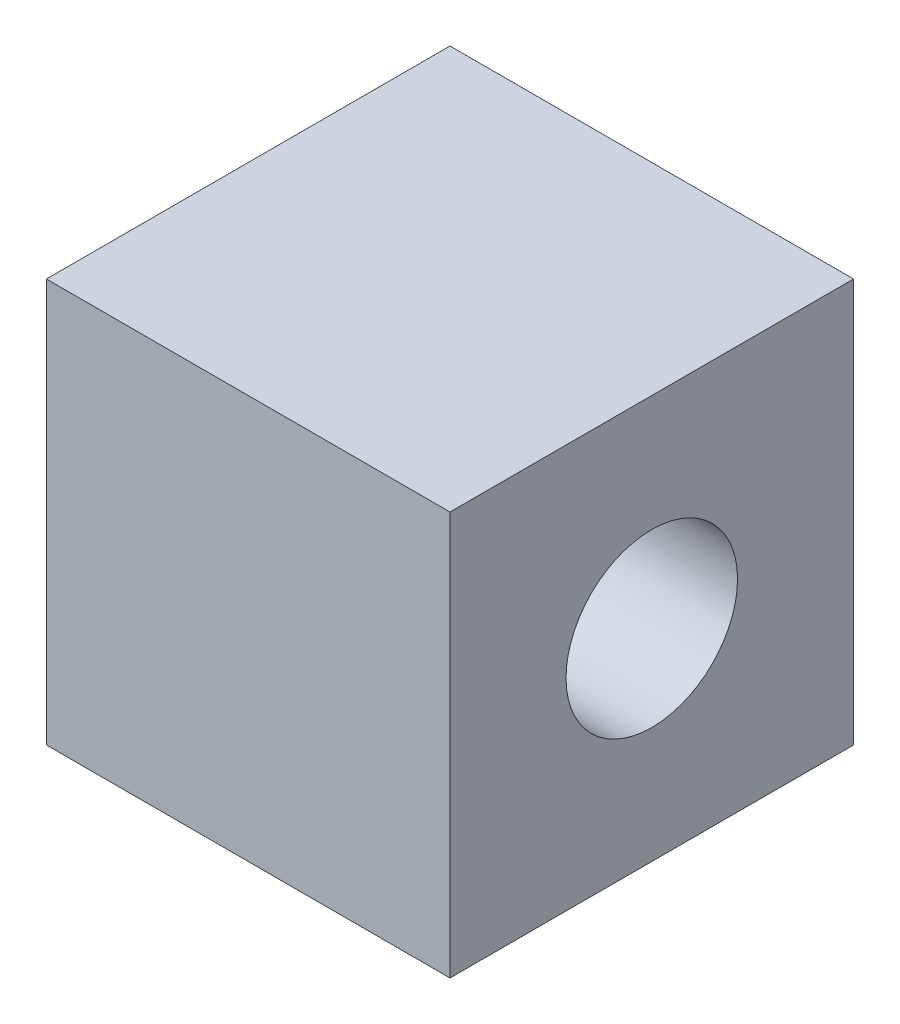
from build123d import *

# Parameters (mm, degrees)
SKETCH1_W           = 20
SKETCH1_H           = 20
BOSS_EXTRUDE1_DEPTH = 20
SKETCH2_R           = 4.25
CUT_EXTRUDE1_DEPTH  = 25.494897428


with BuildPart() as part:
    # Sketch1 → Boss-Extrude1 (new body)
    with BuildSketch(Plane(origin=(0, 0, 0), x_dir=(0, 0, -1), z_dir=(1, 0, 0))):
        Rectangle(SKETCH1_W, SKETCH1_H)
    extrude(amount=BOSS_EXTRUDE1_DEPTH)

    # Sketch2 → Cut-Extrude1 (cut, through all)
    with BuildSketch(Plane(origin=(20, 0, 0), x_dir=(0, 0, -1), z_dir=(1, 0, 0))):
        Circle(SKETCH2_R)
    extrude(amount=-CUT_EXTRUDE1_DEPTH, mode=Mode.SUBTRACT)


solid = part.part
